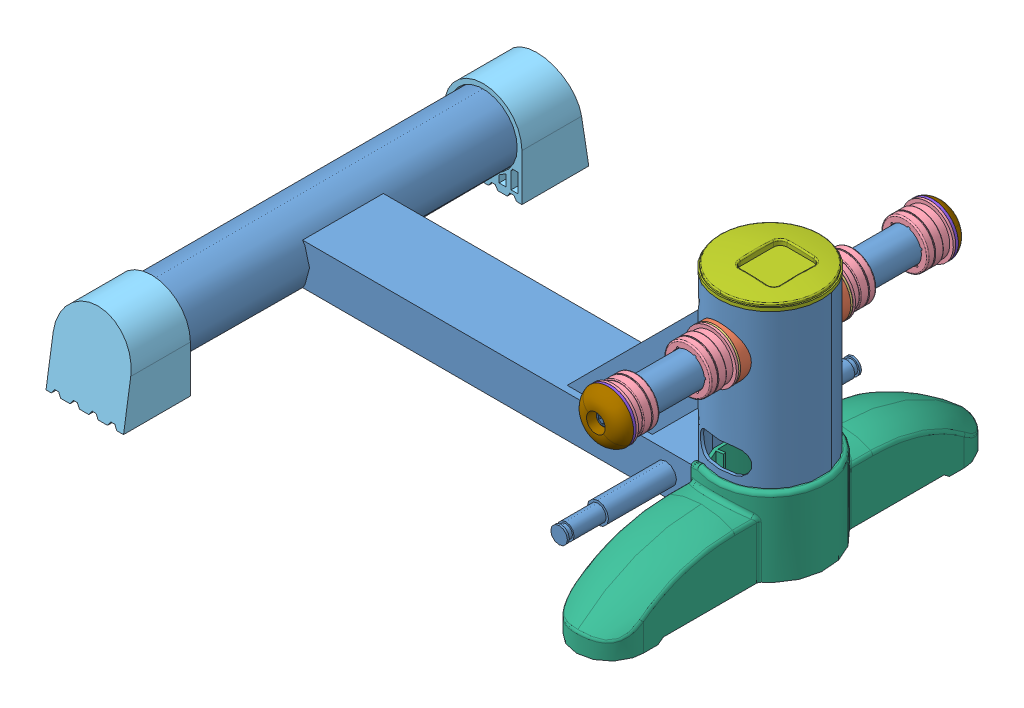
SolidWorks assembly Emsemble corps.SLDASM, configuration aa (file format 11000). Lengths in mm.
Overall size (411 184 348).
19 component instances, 10 part files, 40 mates.
Components (placement in the parent):
- Chassis-1: Chassis.sldprt [Défaut] at (-186.1837 -56.0959 -159) size (403.75 170.5 318)
- Entretoise_plast_14-1: Entretoise_plast_14.sldprt [Défaut] at (153.8163 50.8041 42.45) x (-1 0 0) z (0 0 -1) size (38 38 9.33)
- Entretoise_plast_14-2: Entretoise_plast_14.sldprt [Défaut] at (153.8163 50.8041 -40.05) size (38 38 9.33)
- Rondelle_15_bis-1: Rondelle_15_bis.sldprt [Défaut] at (153.8163 50.8041 42.45) x (0.999619 0.027587 0) z (0 0 1) size (38 38 1.5)
- Rondelle_15_bis-2: Rondelle_15_bis.sldprt [Défaut] at (153.8163 50.8041 -41.55) x (0.969821 0.243819 0) z (0 0 1) size (38 38 1.5)
- Entretoise-1: Entretoise.sldprt [Défaut] at (153.8163 50.8041 29.15) x (0 0 1) z (0.563639 -0.826021 0) size (19.2 38.4 38.4)
- Entretoise-2: Entretoise.sldprt [Défaut] at (153.8163 50.8041 -26.75) x (0 0 -1) z (-0.998715 -0.050679 0) size (19.2 38.4 38.4)
- Entretoise-3: Entretoise.sldprt [Défaut] at (153.8163 50.8041 -133.1) x (0 0 1) z (-0.713376 0.700782 0) size (19.2 38.4 38.4)
- Entretoise-4: Entretoise.sldprt [Défaut] at (153.8163 50.8041 135.5) x (0 0 -1) z (-0.516902 0.856045 0) size (19.2 38.4 38.4)
- Pied_arriere-1: Pied_arriere.sldprt [Défaut] at (-215.1837 -91.0959 124) size (58 64 50)
- Pied_arriere-2: Pied_arriere.sldprt [Défaut] at (-157.1837 -91.0959 -124) x (-1 0 0) z (0 0 -1) size (58 64 50)
- Pied_avant-1: Pied_avant.sldprt [Défaut] at (153.8163 -91.0959 1.2) x (0 0 -1) z (0 -1 0) size (290 84 61.11)
- Compteur-1: Compteur.sldprt [Défaut] at (153.8163 101.3041 1.2) x (0 -1 0) z (0 0 -1) size (76.6 77 77)
- Rondelle_formee_pedale-1: Rondelle_formee_pedale.sldprt [Défaut] at (153.8163 50.8041 127.7) x (0 0 -1) z (-0.354626 0.935008 0) size (7.04 38.4 38.4)
- Rondelle_formee_pedale-2: Rondelle_formee_pedale.sldprt [Défaut] at (153.8163 50.8041 -125.3) x (0 0 1) z (-0.499449 -0.866343 0) size (7.04 38.4 38.4)
- Cache_plastique_16-1: Cache_plastique_16.sldprt [Défaut] at (153.8163 50.8041 105.2678) x (0 0 1) z (-0.811497 0.584357 0) size (14.29 40.39 40.56)
- Cache_plastique_16-2: Cache_plastique_16.sldprt [Défaut] at (153.8163 50.8041 -102.8678) x (0 0 -1) z (-0.883291 -0.468826 0) size (14.29 40.39 40.56)
- ISO_bhcm_M8x1.25_16.0_16.0_He_Sim_1-1: ISO_bhcm_M8x1.25_16.0_16.0_He_Sim_1.sldprt [Défaut] at (153.8163 50.8041 122.7) x (0.52737 0.849636 0) z (0.849636 -0.52737 0) size (14 20.4 14)
- ISO_bhcm_M8x1.25_16.0_16.0_He_Sim_1-2: ISO_bhcm_M8x1.25_16.0_16.0_He_Sim_1.sldprt [Défaut] at (153.8163 50.8041 -120.3) x (0.695204 -0.718813 0) z (0.718813 0.695204 0) size (14 20.4 14)
Mates (geometry in assembly coordinates):
- Coaxial1: concentric: cylinder of Chassis-1 through (153.8163 50.8041 120.7) axis (0 0 -1) radius 12.75; cylinder of Entretoise_plast_14-1 through (153.8163 50.8041 37.1414) axis (0 0 1) radius 13
- Coaxial2: concentric: cylinder of Entretoise_plast_14-1 through (153.8163 31.5758 1.2) axis (0 1 0) radius 38.25; cylinder of Chassis-1 through (153.8163 84.8041 1.2) axis (0 -1 0) radius 38.25
- Coaxial3: concentric: cylinder of Entretoise_plast_14-2 through (153.8163 50.8041 -34.7414) axis (0 0 -1) radius 13; cylinder of Chassis-1 through (153.8163 50.8041 -34.3618) axis (0 0 -1) radius 12.75
- Coaxial4: concentric: cylinder of Entretoise_plast_14-2 through (153.8163 31.5758 1.2) axis (0 1 0) radius 38.25; cylinder of Chassis-1 through (153.8163 84.8041 1.2) axis (0 -1 0) radius 38.25
- Coaxial5: concentric: cylinder of Chassis-1 through (153.8163 50.8041 120.7) axis (0 0 -1) radius 12.75; cylinder of Rondelle_15_bis-1 through (153.8163 50.8041 43.95) axis (0 0 -1) radius 13.15
- Coaxial6: concentric: cylinder of Rondelle_15_bis-2 through (153.8163 50.8041 -40.05) axis (0 0 -1) radius 13.15; cylinder of Chassis-1 through (153.8163 50.8041 -34.3618) axis (0 0 -1) radius 12.75
- Coïncidente1: coincident: plane of Entretoise_plast_14-1 through (173.0443 31.51 42.45) normal (0 0 1); plane of Rondelle_15_bis-1 through (135.1279 30.9869 42.45) normal (0 0 -1)
- Distance2: distance: plane of Entretoise_plast_14-2 through (134.5883 31.51 -40.05) normal (0 0 -1); plane of Rondelle_15_bis-2 through (139.8728 27.4041 -40.05) normal (0 0 1)
- Coaxial9: concentric: cylinder of Chassis-1 through (153.8163 50.8041 -34.3618) axis (0 0 -1) radius 12.75; cylinder of Entretoise-2 through (153.8163 50.8041 -49.35) axis (0 0 -1) radius 17.5
- Distance4: distance: plane of Rondelle_15_bis-1 through (135.1279 30.9869 43.95) normal (0 0 1); plane of Entretoise-1 through (158.9697 77.8435 43.95) normal (0 0 -1)
- Coaxial12: concentric: cylinder of Entretoise-3 through (153.8163 50.8041 -110.5) axis (0 0 1) radius 17.5; cylinder of Chassis-1 through (153.8163 50.8041 -34.3618) axis (0 0 -1) radius 12.75
- Distance5: distance: plane of Entretoise-4 through (180.5504 44.249 120.7) normal (0 0 1); plane of Rondelle_formee_pedale-1 through (179.0561 39.4715 120.7) normal (0 0 -1)
- Coaxial20: concentric: cylinder of Chassis-1 through (-186.1837 -56.0959 159) axis (0 0 -1) radius 25.5; cylinder of Pied_arriere-1 through (-186.1837 -56.0959 159) axis (0 0 -1) radius 25.5
- Distance21: distance: plane of Chassis-1 through (-212.1443 -82.1013 -159) normal (0 0 -1); plane of Pied_arriere-2 through (-212.1443 -82.1013 -159) normal (0 0 1)
- Parallèle1: parallel: plane of Pied_arriere-2 through (-196.1837 -91.0959 -124) normal (0 -1 0); plane of Chassis-1 through (-165.8591 -71.4959 31.4) normal (0 -1 0)
- Coaxial22: concentric: cylinder of Chassis-1 through (153.8163 84.8041 1.2) axis (0 -1 0) radius 38.25; cylinder of Pied_avant-1 through (153.8163 -33.0959 1.2) axis (0 -1 0) radius 42
- Coaxial23: concentric: cylinder of Chassis-1 through (153.8163 84.8041 1.2) axis (0 -1 0) radius 38.25; cylinder of Compteur-1 through (153.8163 51.8041 1.2) axis (0 1 0) radius 36.1
- Coaxial24: concentric: cylinder of Chassis-1 through (153.8163 50.8041 120.7) axis (0 0 -1) radius 12.75; cone of Rondelle_formee_pedale-1 through (153.8163 50.8041 117.9557) axis (0 0 -1)
- Distance6: distance: plane of Rondelle_15_bis-2 through (139.8728 27.4041 -41.55) normal (0 0 -1); plane of Entretoise-2 through (172.2336 71.2611 -41.55) normal (0 0 1)
- Coaxial25: concentric: cylinder of Chassis-1 through (153.8163 50.8041 120.7) axis (0 0 -1) radius 10.75; cylinder of Rondelle_formee_pedale-2 through (153.8163 50.8041 -113.26) axis (0 0 -1) radius 4
- Distance8: distance: plane of Chassis-1 through (140.836 37.8014 120.7) normal (0 0 1); plane of Rondelle_formee_pedale-1 through (179.0561 39.4715 120.7) normal (0 0 -1)
- Coaxial26: concentric: cylinder of Chassis-1 through (153.8163 50.8041 120.7) axis (0 0 -1) radius 12.75; cylinder of Cache_plastique_16-1 through (153.8163 50.8041 121.2) axis (0 0 1) radius 9.5
- Distance13: distance: plane of Chassis-1 through (140.836 37.8014 -118.3) normal (0 0 -1); plane of Rondelle_formee_pedale-2 through (180.5424 57.9589 -118.3) normal (0 0 1)
- Distance16: distance: plane of Rondelle_formee_pedale-2 through (161.0749 24.1907 -120.3) normal (0 0 -1); plane of Cache_plastique_16-2 through (161.8382 77.1354 -120.3) normal (0 0 1)
- Coaxial38: concentric: cylinder of Rondelle_formee_pedale-2 through (153.8163 50.8041 -113.26) axis (0 0 -1) radius 4; cylinder of Cache_plastique_16-2 through (153.8163 50.8041 -120.8) axis (0 0 -1) radius 7
- Coaxial55: concentric: cylinder of Chassis-1 through (153.8163 50.8041 120.7) axis (0 0 -1) radius 12.75; cylinder of Entretoise-1 through (153.8163 50.8041 58.15) axis (0 0 1) radius 17.5
- Distance12: distance: plane of Rondelle_formee_pedale-1 through (165.2335 75.9162 122.7) normal (0 0 1); plane of Cache_plastique_16-1 through (158.1906 23.6279 122.7) normal (0 0 -1)
- Coaxiale6: concentric: cylinder of Chassis-1 through (153.8163 50.8041 120.7) axis (0 0 -1) radius 12.75; cylinder of Entretoise-4 through (153.8163 50.8041 112.9) axis (0 0 -1) radius 17.5
- Distance18: distance: plane of Entretoise-3 through (154.0141 23.2788 -118.3) normal (0 0 -1); plane of Rondelle_formee_pedale-2 through (180.5424 57.9589 -118.3) normal (0 0 1)
- Coïncidente36: coincident: plane of Chassis-1 through (114.8081 84.8041 -37.7409) normal (0 1 0); plane of Compteur-1 through (192.9123 84.8041 40.162) normal (0 -1 0)
- Coaxiale9: concentric: cylinder of Chassis-1 through (-186.1837 -56.0959 159) axis (0 0 -1) radius 25.5; cylinder of Pied_arriere-2 through (-186.1837 -56.0959 -159) axis (0 0 1) radius 25.5
- Distance23: distance: plane of Chassis-1 through (-212.1443 -82.1013 159) normal (0 0 1); plane of Pied_arriere-1 through (-160.2231 -82.1013 159) normal (0 0 -1)
- Parallèle3: parallel: plane of Chassis-1 through (-165.8591 -71.4959 31.4) normal (0 -1 0); plane of Pied_arriere-1 through (-190.1837 -91.0959 124) normal (0 -1 0)
- Coïncidente40: coincident: plane of Chassis-1 through (114.8081 -85.6959 -37.7409) normal (0 -1 0); plane of Pied_avant-1 through (119.7308 -85.6959 -32.7031) normal (0 1 0)
- Parallèle4: parallel: line of Chassis-1 through (-165.8591 -40.6959 -29) axis (0 0 1); plane of Pied_avant-1 through (128.8163 -49.085 121.2) normal (-1 0 0)
- Parallèle5: parallel: line of Chassis-1 through (-165.8591 -40.6959 -29) axis (0 0 1); plane of Compteur-1 through (143.8163 91.9205 -11.3) normal (1 0 0)
- Coaxiale10: concentric: cylinder of Cache_plastique_16-1 through (153.8163 50.8041 123.2) axis (0 0 1) radius 7; cylinder of ISO_bhcm_M8x1.25_16.0_16.0_He_Sim_1-1 through (153.8163 50.8041 122.7) axis (0 0 -1) radius 4
- Coïncidente41: coincident: plane of Cache_plastique_16-1 through (144.6211 49.2917 122.7) normal (0 0 1); plane of ISO_bhcm_M8x1.25_16.0_16.0_He_Sim_1-1 through (156.0863 41.0287 122.7) normal (0 0 -1)
- Coïncidente42: coincident: plane of Cache_plastique_16-2 through (144.9114 53.5505 -120.3) normal (0 0 -1); plane of ISO_bhcm_M8x1.25_16.0_16.0_He_Sim_1-2 through (153.9666 60.8386 -120.3) normal (0 0 1)
- Coaxiale11: concentric: cylinder of Cache_plastique_16-2 through (153.8163 50.8041 -120.8) axis (0 0 -1) radius 7; cylinder of ISO_bhcm_M8x1.25_16.0_16.0_He_Sim_1-2 through (153.8163 50.8041 -120.3) axis (0 0 1) radius 4
